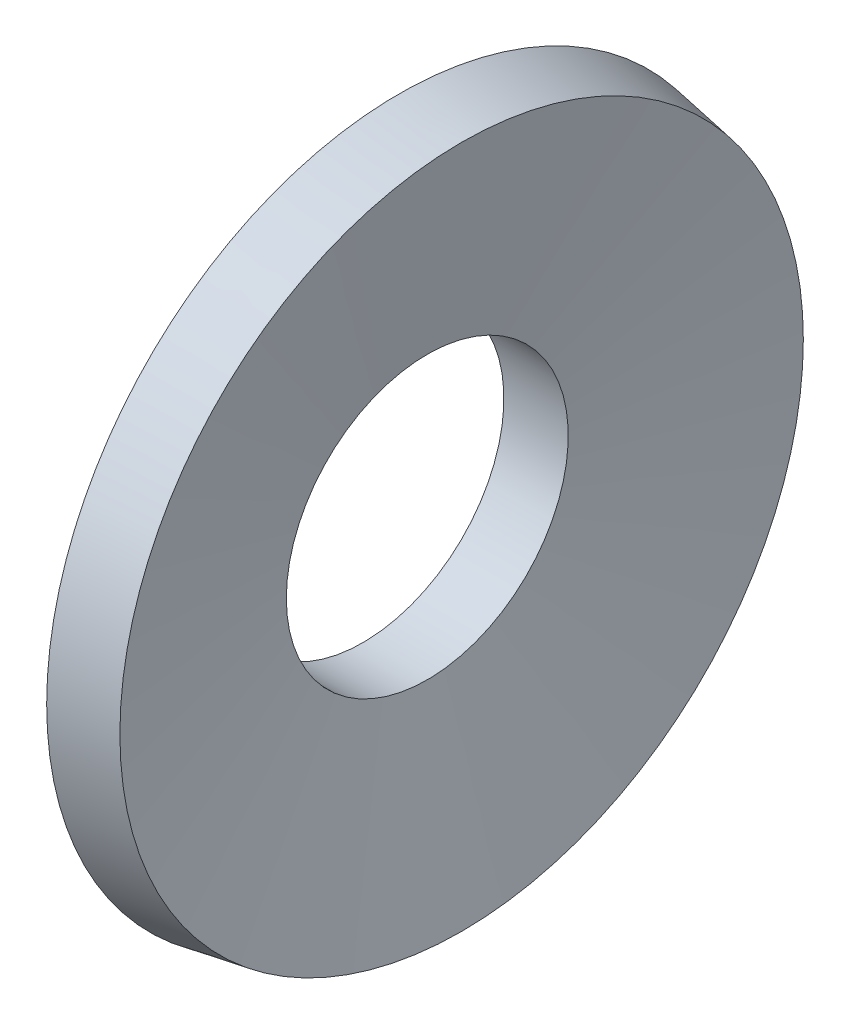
ISO-10303-21;
HEADER;
FILE_DESCRIPTION(('STEP AP214'),'2;1');
FILE_NAME('part.step','',(''),(''),'','','');
FILE_SCHEMA(('AUTOMOTIVE_DESIGN { 1 0 10303 214 1 1 1 1 }'));
ENDSEC;
DATA;
#1=APPLICATION_CONTEXT('core data for automotive mechanical design processes');
#2=APPLICATION_PROTOCOL_DEFINITION('international standard','automotive_design',2000,#1);
#3=PRODUCT_CONTEXT('',#1,'mechanical');
#4=PRODUCT('Part','Part','',(#3));
#5=PRODUCT_RELATED_PRODUCT_CATEGORY('part','',(#4));
#6=PRODUCT_DEFINITION_FORMATION('','',#4);
#7=PRODUCT_DEFINITION_CONTEXT('part definition',#1,'design');
#8=PRODUCT_DEFINITION('design','',#6,#7);
#9=PRODUCT_DEFINITION_SHAPE('','',#8);
#10=(LENGTH_UNIT() NAMED_UNIT(*) SI_UNIT(.MILLI.,.METRE.));
#11=(NAMED_UNIT(*) PLANE_ANGLE_UNIT() SI_UNIT($,.RADIAN.));
#12=(NAMED_UNIT(*) SI_UNIT($,.STERADIAN.) SOLID_ANGLE_UNIT());
#13=UNCERTAINTY_MEASURE_WITH_UNIT(LENGTH_MEASURE(1.E-05),#10,'distance_accuracy_value','');
#14=(GEOMETRIC_REPRESENTATION_CONTEXT(3) GLOBAL_UNCERTAINTY_ASSIGNED_CONTEXT((#13)) GLOBAL_UNIT_ASSIGNED_CONTEXT((#10,
#11,#12)) REPRESENTATION_CONTEXT('',''));
#15=CARTESIAN_POINT('',(0.,0.,0.));
#16=DIRECTION('',(0.,0.,1.));
#17=DIRECTION('',(1.,0.,0.));
#18=AXIS2_PLACEMENT_3D('',#15,#16,#17);
#19=CARTESIAN_POINT('',(0.,0.,0.));
#20=DIRECTION('',(-1.,0.,0.));
#21=DIRECTION('',(0.,0.,1.));
#22=AXIS2_PLACEMENT_3D('',#19,#20,#21);
#23=CYLINDRICAL_SURFACE('',#22,2.);
#24=CARTESIAN_POINT('',(0.913057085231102,0.,0.));
#25=DIRECTION('',(-1.,0.,0.));
#26=DIRECTION('',(0.,0.,1.));
#27=AXIS2_PLACEMENT_3D('',#24,#25,#26);
#28=CIRCLE('',#27,2.);
#29=CARTESIAN_POINT('',(0.913057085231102,0.,2.));
#30=VERTEX_POINT('',#29);
#31=EDGE_CURVE('E10',#30,#30,#28,.T.);
#32=ORIENTED_EDGE('',*,*,#31,.F.);
#33=EDGE_LOOP('',(#32));
#34=FACE_BOUND('',#33,.T.);
#35=CARTESIAN_POINT('',(0.,0.,0.));
#36=DIRECTION('',(-1.,0.,0.));
#37=DIRECTION('',(0.,0.,1.));
#38=AXIS2_PLACEMENT_3D('',#35,#36,#37);
#39=CIRCLE('',#38,2.);
#40=CARTESIAN_POINT('',(0.,0.,2.));
#41=VERTEX_POINT('',#40);
#42=EDGE_CURVE('E41',#41,#41,#39,.T.);
#43=ORIENTED_EDGE('',*,*,#42,.T.);
#44=EDGE_LOOP('',(#43));
#45=FACE_BOUND('',#44,.T.);
#46=ADVANCED_FACE('F27',(#34,#45),#23,.F.);
#47=CARTESIAN_POINT('',(0.913057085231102,0.,0.));
#48=DIRECTION('',(1.,0.,0.));
#49=DIRECTION('',(0.,0.,-1.));
#50=AXIS2_PLACEMENT_3D('',#47,#48,#49);
#51=CONICAL_SURFACE('',#50,2.,1.4014764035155);
#52=CARTESIAN_POINT('',(1.4,0.,0.));
#53=DIRECTION('',(-1.,0.,0.));
#54=DIRECTION('',(0.,0.,1.));
#55=AXIS2_PLACEMENT_3D('',#52,#53,#54);
#56=CIRCLE('',#55,4.84833916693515);
#57=CARTESIAN_POINT('',(1.4,0.,4.84833916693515));
#58=VERTEX_POINT('',#57);
#59=EDGE_CURVE('E33',#58,#58,#56,.T.);
#60=ORIENTED_EDGE('',*,*,#59,.F.);
#61=EDGE_LOOP('',(#60));
#62=FACE_BOUND('',#61,.T.);
#63=ORIENTED_EDGE('',*,*,#31,.T.);
#64=EDGE_LOOP('',(#63));
#65=FACE_BOUND('',#64,.T.);
#66=ADVANCED_FACE('F56',(#62,#65),#51,.F.);
#67=CARTESIAN_POINT('',(1.4,0.,0.));
#68=DIRECTION('',(-1.,0.,0.));
#69=DIRECTION('',(0.,0.,1.));
#70=AXIS2_PLACEMENT_3D('',#67,#68,#69);
#71=CONICAL_SURFACE('',#70,4.84833916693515,0.169319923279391);
#72=CARTESIAN_POINT('',(0.512870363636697,0.,0.));
#73=DIRECTION('',(-1.,0.,0.));
#74=DIRECTION('',(0.,0.,1.));
#75=AXIS2_PLACEMENT_3D('',#72,#73,#74);
#76=CIRCLE('',#75,5.);
#77=CARTESIAN_POINT('',(0.512870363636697,0.,5.));
#78=VERTEX_POINT('',#77);
#79=EDGE_CURVE('E37',#78,#78,#76,.T.);
#80=ORIENTED_EDGE('',*,*,#79,.F.);
#81=EDGE_LOOP('',(#80));
#82=FACE_BOUND('',#81,.T.);
#83=ORIENTED_EDGE('',*,*,#59,.T.);
#84=EDGE_LOOP('',(#83));
#85=FACE_BOUND('',#84,.T.);
#86=ADVANCED_FACE('F51',(#82,#85),#71,.T.);
#87=CARTESIAN_POINT('',(0.512870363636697,0.,0.));
#88=DIRECTION('',(1.,0.,0.));
#89=DIRECTION('',(0.,0.,-1.));
#90=AXIS2_PLACEMENT_3D('',#87,#88,#89);
#91=CONICAL_SURFACE('',#90,5.,1.40147640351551);
#92=ORIENTED_EDGE('',*,*,#42,.F.);
#93=EDGE_LOOP('',(#92));
#94=FACE_BOUND('',#93,.T.);
#95=ORIENTED_EDGE('',*,*,#79,.T.);
#96=EDGE_LOOP('',(#95));
#97=FACE_BOUND('',#96,.T.);
#98=ADVANCED_FACE('F48',(#94,#97),#91,.T.);
#99=CLOSED_SHELL('',(#46,#66,#86,#98));
#100=MANIFOLD_SOLID_BREP('B2',#99);
#101=ADVANCED_BREP_SHAPE_REPRESENTATION('',(#18,#100),#14);
#102=SHAPE_DEFINITION_REPRESENTATION(#9,#101);
ENDSEC;
END-ISO-10303-21;
